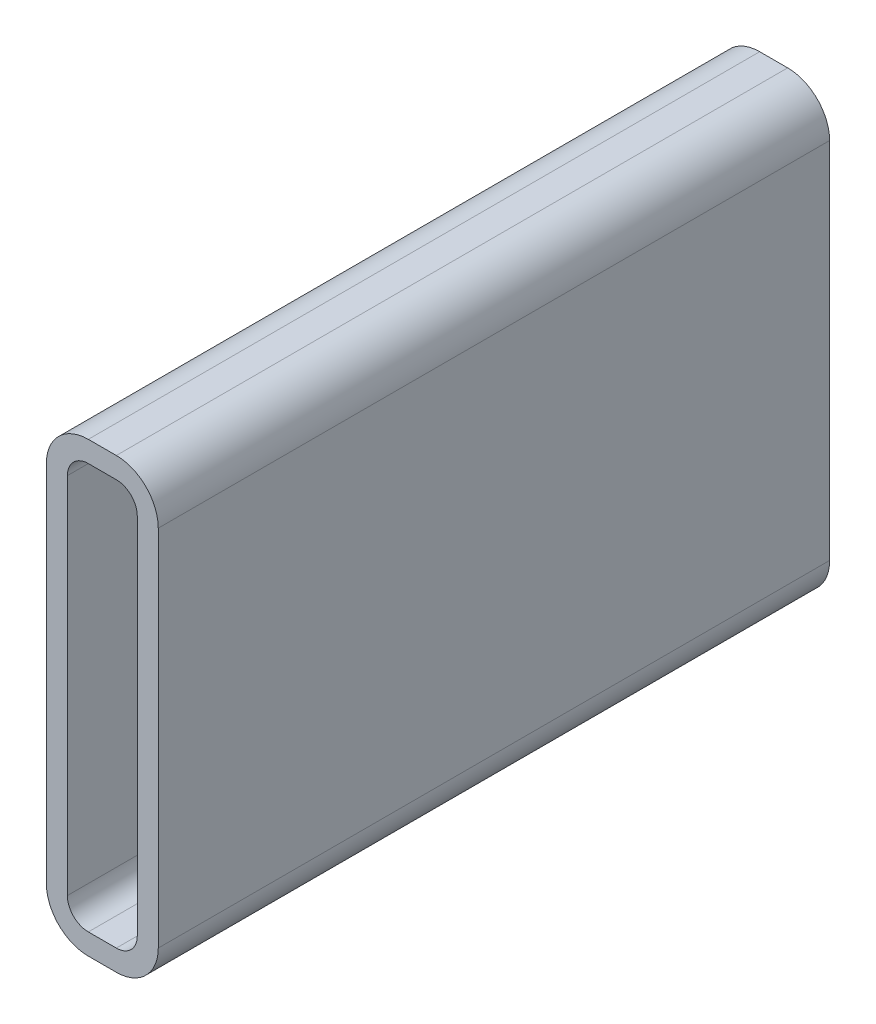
ISO-10303-21;
HEADER;
FILE_DESCRIPTION(('STEP AP214'),'2;1');
FILE_NAME('part.step','',(''),(''),'','','');
FILE_SCHEMA(('AUTOMOTIVE_DESIGN { 1 0 10303 214 1 1 1 1 }'));
ENDSEC;
DATA;
#1=APPLICATION_CONTEXT('core data for automotive mechanical design processes');
#2=APPLICATION_PROTOCOL_DEFINITION('international standard','automotive_design',2000,#1);
#3=PRODUCT_CONTEXT('',#1,'mechanical');
#4=PRODUCT('Part','Part','',(#3));
#5=PRODUCT_RELATED_PRODUCT_CATEGORY('part','',(#4));
#6=PRODUCT_DEFINITION_FORMATION('','',#4);
#7=PRODUCT_DEFINITION_CONTEXT('part definition',#1,'design');
#8=PRODUCT_DEFINITION('design','',#6,#7);
#9=PRODUCT_DEFINITION_SHAPE('','',#8);
#10=(LENGTH_UNIT() NAMED_UNIT(*) SI_UNIT(.MILLI.,.METRE.));
#11=(NAMED_UNIT(*) PLANE_ANGLE_UNIT() SI_UNIT($,.RADIAN.));
#12=(NAMED_UNIT(*) SI_UNIT($,.STERADIAN.) SOLID_ANGLE_UNIT());
#13=UNCERTAINTY_MEASURE_WITH_UNIT(LENGTH_MEASURE(1.E-05),#10,'distance_accuracy_value','');
#14=(GEOMETRIC_REPRESENTATION_CONTEXT(3) GLOBAL_UNCERTAINTY_ASSIGNED_CONTEXT((#13)) GLOBAL_UNIT_ASSIGNED_CONTEXT((#10,
#11,#12)) REPRESENTATION_CONTEXT('',''));
#15=CARTESIAN_POINT('',(0.,0.,0.));
#16=DIRECTION('',(0.,0.,1.));
#17=DIRECTION('',(1.,0.,0.));
#18=AXIS2_PLACEMENT_3D('',#15,#16,#17);
#19=CARTESIAN_POINT('',(19.05,184.15,304.8));
#20=DIRECTION('',(0.,0.,1.));
#21=DIRECTION('',(1.,0.,0.));
#22=AXIS2_PLACEMENT_3D('',#19,#20,#21);
#23=PLANE('',#22);
#24=CARTESIAN_POINT('',(19.05,184.15,304.8));
#25=DIRECTION('',(0.,0.,1.));
#26=DIRECTION('',(1.,0.,0.));
#27=AXIS2_PLACEMENT_3D('',#24,#25,#26);
#28=CIRCLE('',#27,19.05);
#29=CARTESIAN_POINT('',(19.05,203.2,304.8));
#30=VERTEX_POINT('',#29);
#31=CARTESIAN_POINT('',(0.,184.15,304.8));
#32=VERTEX_POINT('',#31);
#33=EDGE_CURVE('E211',#30,#32,#28,.T.);
#34=ORIENTED_EDGE('',*,*,#33,.T.);
#35=DIRECTION('',(0.,-1.,0.));
#36=VECTOR('',#35,1.);
#37=CARTESIAN_POINT('',(0.,19.05,304.8));
#38=LINE('',#37,#36);
#39=CARTESIAN_POINT('',(0.,19.05,304.8));
#40=VERTEX_POINT('',#39);
#41=EDGE_CURVE('E214',#32,#40,#38,.T.);
#42=ORIENTED_EDGE('',*,*,#41,.T.);
#43=CARTESIAN_POINT('',(19.05,19.05,304.8));
#44=DIRECTION('',(0.,0.,1.));
#45=DIRECTION('',(1.,0.,0.));
#46=AXIS2_PLACEMENT_3D('',#43,#44,#45);
#47=CIRCLE('',#46,19.05);
#48=CARTESIAN_POINT('',(19.05,0.,304.8));
#49=VERTEX_POINT('',#48);
#50=EDGE_CURVE('E217',#40,#49,#47,.T.);
#51=ORIENTED_EDGE('',*,*,#50,.T.);
#52=DIRECTION('',(1.,0.,0.));
#53=VECTOR('',#52,1.);
#54=CARTESIAN_POINT('',(31.75,0.,304.8));
#55=LINE('',#54,#53);
#56=CARTESIAN_POINT('',(31.75,0.,304.8));
#57=VERTEX_POINT('',#56);
#58=EDGE_CURVE('E219',#49,#57,#55,.T.);
#59=ORIENTED_EDGE('',*,*,#58,.T.);
#60=CARTESIAN_POINT('',(31.75,19.05,304.8));
#61=DIRECTION('',(0.,0.,1.));
#62=DIRECTION('',(1.,0.,0.));
#63=AXIS2_PLACEMENT_3D('',#60,#61,#62);
#64=CIRCLE('',#63,19.05);
#65=CARTESIAN_POINT('',(50.8,19.05,304.8));
#66=VERTEX_POINT('',#65);
#67=EDGE_CURVE('E221',#57,#66,#64,.T.);
#68=ORIENTED_EDGE('',*,*,#67,.T.);
#69=DIRECTION('',(0.,1.,0.));
#70=VECTOR('',#69,1.);
#71=CARTESIAN_POINT('',(50.8,184.15,304.8));
#72=LINE('',#71,#70);
#73=CARTESIAN_POINT('',(50.8,184.15,304.8));
#74=VERTEX_POINT('',#73);
#75=EDGE_CURVE('E223',#66,#74,#72,.T.);
#76=ORIENTED_EDGE('',*,*,#75,.T.);
#77=CARTESIAN_POINT('',(31.75,184.15,304.8));
#78=DIRECTION('',(0.,0.,1.));
#79=DIRECTION('',(1.,0.,0.));
#80=AXIS2_PLACEMENT_3D('',#77,#78,#79);
#81=CIRCLE('',#80,19.05);
#82=CARTESIAN_POINT('',(31.75,203.2,304.8));
#83=VERTEX_POINT('',#82);
#84=EDGE_CURVE('E225',#74,#83,#81,.T.);
#85=ORIENTED_EDGE('',*,*,#84,.T.);
#86=DIRECTION('',(-1.,0.,0.));
#87=VECTOR('',#86,1.);
#88=CARTESIAN_POINT('',(19.05,203.2,304.8));
#89=LINE('',#88,#87);
#90=EDGE_CURVE('E227',#83,#30,#89,.T.);
#91=ORIENTED_EDGE('',*,*,#90,.T.);
#92=EDGE_LOOP('',(#34,#42,#51,#59,#68,#76,#85,#91));
#93=FACE_BOUND('',#92,.T.);
#94=DIRECTION('',(0.,-1.,0.));
#95=VECTOR('',#94,1.);
#96=CARTESIAN_POINT('',(9.525,19.05,304.8));
#97=LINE('',#96,#95);
#98=CARTESIAN_POINT('',(9.525,184.15,304.8));
#99=VERTEX_POINT('',#98);
#100=CARTESIAN_POINT('',(9.525,19.05,304.8));
#101=VERTEX_POINT('',#100);
#102=EDGE_CURVE('E154',#99,#101,#97,.T.);
#103=ORIENTED_EDGE('',*,*,#102,.F.);
#104=CARTESIAN_POINT('',(19.05,184.15,304.8));
#105=DIRECTION('',(0.,0.,1.));
#106=DIRECTION('',(1.,0.,0.));
#107=AXIS2_PLACEMENT_3D('',#104,#105,#106);
#108=CIRCLE('',#107,9.525);
#109=CARTESIAN_POINT('',(19.05,193.675,304.8));
#110=VERTEX_POINT('',#109);
#111=EDGE_CURVE('E146',#110,#99,#108,.T.);
#112=ORIENTED_EDGE('',*,*,#111,.F.);
#113=DIRECTION('',(-1.,0.,0.));
#114=VECTOR('',#113,1.);
#115=CARTESIAN_POINT('',(19.05,193.675,304.8));
#116=LINE('',#115,#114);
#117=CARTESIAN_POINT('',(31.75,193.675,304.8));
#118=VERTEX_POINT('',#117);
#119=EDGE_CURVE('E179',#118,#110,#116,.T.);
#120=ORIENTED_EDGE('',*,*,#119,.F.);
#121=CARTESIAN_POINT('',(31.75,184.15,304.8));
#122=DIRECTION('',(0.,0.,1.));
#123=DIRECTION('',(1.,0.,0.));
#124=AXIS2_PLACEMENT_3D('',#121,#122,#123);
#125=CIRCLE('',#124,9.525);
#126=CARTESIAN_POINT('',(41.275,184.15,304.8));
#127=VERTEX_POINT('',#126);
#128=EDGE_CURVE('E177',#127,#118,#125,.T.);
#129=ORIENTED_EDGE('',*,*,#128,.F.);
#130=DIRECTION('',(0.,1.,0.));
#131=VECTOR('',#130,1.);
#132=CARTESIAN_POINT('',(41.275,184.15,304.8));
#133=LINE('',#132,#131);
#134=CARTESIAN_POINT('',(41.275,19.05,304.8));
#135=VERTEX_POINT('',#134);
#136=EDGE_CURVE('E175',#135,#127,#133,.T.);
#137=ORIENTED_EDGE('',*,*,#136,.F.);
#138=CARTESIAN_POINT('',(31.75,19.05,304.8));
#139=DIRECTION('',(0.,0.,1.));
#140=DIRECTION('',(1.,0.,0.));
#141=AXIS2_PLACEMENT_3D('',#138,#139,#140);
#142=CIRCLE('',#141,9.525);
#143=CARTESIAN_POINT('',(31.75,9.525,304.8));
#144=VERTEX_POINT('',#143);
#145=EDGE_CURVE('E173',#144,#135,#142,.T.);
#146=ORIENTED_EDGE('',*,*,#145,.F.);
#147=DIRECTION('',(1.,0.,0.));
#148=VECTOR('',#147,1.);
#149=CARTESIAN_POINT('',(31.75,9.525,304.8));
#150=LINE('',#149,#148);
#151=CARTESIAN_POINT('',(19.05,9.525,304.8));
#152=VERTEX_POINT('',#151);
#153=EDGE_CURVE('E169',#152,#144,#150,.T.);
#154=ORIENTED_EDGE('',*,*,#153,.F.);
#155=CARTESIAN_POINT('',(19.05,19.05,304.8));
#156=DIRECTION('',(0.,0.,1.));
#157=DIRECTION('',(1.,0.,0.));
#158=AXIS2_PLACEMENT_3D('',#155,#156,#157);
#159=CIRCLE('',#158,9.525);
#160=EDGE_CURVE('E167',#101,#152,#159,.T.);
#161=ORIENTED_EDGE('',*,*,#160,.F.);
#162=EDGE_LOOP('',(#103,#112,#120,#129,#137,#146,#154,#161));
#163=FACE_BOUND('',#162,.T.);
#164=ADVANCED_FACE('F33',(#93,#163),#23,.T.);
#165=CARTESIAN_POINT('',(19.05,184.15,0.));
#166=DIRECTION('',(0.,0.,1.));
#167=DIRECTION('',(1.,0.,0.));
#168=AXIS2_PLACEMENT_3D('',#165,#166,#167);
#169=PLANE('',#168);
#170=CARTESIAN_POINT('',(19.05,184.15,0.));
#171=DIRECTION('',(0.,0.,1.));
#172=DIRECTION('',(1.,0.,0.));
#173=AXIS2_PLACEMENT_3D('',#170,#171,#172);
#174=CIRCLE('',#173,19.05);
#175=CARTESIAN_POINT('',(19.05,203.2,0.));
#176=VERTEX_POINT('',#175);
#177=CARTESIAN_POINT('',(0.,184.15,0.));
#178=VERTEX_POINT('',#177);
#179=EDGE_CURVE('E162',#176,#178,#174,.T.);
#180=ORIENTED_EDGE('',*,*,#179,.F.);
#181=DIRECTION('',(-1.,0.,0.));
#182=VECTOR('',#181,1.);
#183=CARTESIAN_POINT('',(19.05,203.2,0.));
#184=LINE('',#183,#182);
#185=CARTESIAN_POINT('',(31.75,203.2,0.));
#186=VERTEX_POINT('',#185);
#187=EDGE_CURVE('E215',#186,#176,#184,.T.);
#188=ORIENTED_EDGE('',*,*,#187,.F.);
#189=CARTESIAN_POINT('',(31.75,184.15,0.));
#190=DIRECTION('',(0.,0.,1.));
#191=DIRECTION('',(1.,0.,0.));
#192=AXIS2_PLACEMENT_3D('',#189,#190,#191);
#193=CIRCLE('',#192,19.05);
#194=CARTESIAN_POINT('',(50.8,184.15,0.));
#195=VERTEX_POINT('',#194);
#196=EDGE_CURVE('E242',#195,#186,#193,.T.);
#197=ORIENTED_EDGE('',*,*,#196,.F.);
#198=DIRECTION('',(0.,1.,0.));
#199=VECTOR('',#198,1.);
#200=CARTESIAN_POINT('',(50.8,184.15,0.));
#201=LINE('',#200,#199);
#202=CARTESIAN_POINT('',(50.8,19.05,0.));
#203=VERTEX_POINT('',#202);
#204=EDGE_CURVE('E240',#203,#195,#201,.T.);
#205=ORIENTED_EDGE('',*,*,#204,.F.);
#206=CARTESIAN_POINT('',(31.75,19.05,0.));
#207=DIRECTION('',(0.,0.,1.));
#208=DIRECTION('',(1.,0.,0.));
#209=AXIS2_PLACEMENT_3D('',#206,#207,#208);
#210=CIRCLE('',#209,19.05);
#211=CARTESIAN_POINT('',(31.75,0.,0.));
#212=VERTEX_POINT('',#211);
#213=EDGE_CURVE('E238',#212,#203,#210,.T.);
#214=ORIENTED_EDGE('',*,*,#213,.F.);
#215=DIRECTION('',(1.,0.,0.));
#216=VECTOR('',#215,1.);
#217=CARTESIAN_POINT('',(31.75,0.,0.));
#218=LINE('',#217,#216);
#219=CARTESIAN_POINT('',(19.05,0.,0.));
#220=VERTEX_POINT('',#219);
#221=EDGE_CURVE('E236',#220,#212,#218,.T.);
#222=ORIENTED_EDGE('',*,*,#221,.F.);
#223=CARTESIAN_POINT('',(19.05,19.05,0.));
#224=DIRECTION('',(0.,0.,1.));
#225=DIRECTION('',(1.,0.,0.));
#226=AXIS2_PLACEMENT_3D('',#223,#224,#225);
#227=CIRCLE('',#226,19.05);
#228=CARTESIAN_POINT('',(0.,19.05,0.));
#229=VERTEX_POINT('',#228);
#230=EDGE_CURVE('E234',#229,#220,#227,.T.);
#231=ORIENTED_EDGE('',*,*,#230,.F.);
#232=DIRECTION('',(0.,-1.,0.));
#233=VECTOR('',#232,1.);
#234=CARTESIAN_POINT('',(0.,19.05,0.));
#235=LINE('',#234,#233);
#236=EDGE_CURVE('E232',#178,#229,#235,.T.);
#237=ORIENTED_EDGE('',*,*,#236,.F.);
#238=EDGE_LOOP('',(#180,#188,#197,#205,#214,#222,#231,#237));
#239=FACE_BOUND('',#238,.T.);
#240=CARTESIAN_POINT('',(19.05,184.15,0.));
#241=DIRECTION('',(0.,0.,1.));
#242=DIRECTION('',(1.,0.,0.));
#243=AXIS2_PLACEMENT_3D('',#240,#241,#242);
#244=CIRCLE('',#243,9.525);
#245=CARTESIAN_POINT('',(19.05,193.675,0.));
#246=VERTEX_POINT('',#245);
#247=CARTESIAN_POINT('',(9.525,184.15,0.));
#248=VERTEX_POINT('',#247);
#249=EDGE_CURVE('E56',#246,#248,#244,.T.);
#250=ORIENTED_EDGE('',*,*,#249,.T.);
#251=DIRECTION('',(0.,-1.,0.));
#252=VECTOR('',#251,1.);
#253=CARTESIAN_POINT('',(9.525,19.05,0.));
#254=LINE('',#253,#252);
#255=CARTESIAN_POINT('',(9.525,19.05,0.));
#256=VERTEX_POINT('',#255);
#257=EDGE_CURVE('E161',#248,#256,#254,.T.);
#258=ORIENTED_EDGE('',*,*,#257,.T.);
#259=CARTESIAN_POINT('',(19.05,19.05,0.));
#260=DIRECTION('',(0.,0.,1.));
#261=DIRECTION('',(1.,0.,0.));
#262=AXIS2_PLACEMENT_3D('',#259,#260,#261);
#263=CIRCLE('',#262,9.525);
#264=CARTESIAN_POINT('',(19.05,9.525,0.));
#265=VERTEX_POINT('',#264);
#266=EDGE_CURVE('E183',#256,#265,#263,.T.);
#267=ORIENTED_EDGE('',*,*,#266,.T.);
#268=DIRECTION('',(1.,0.,0.));
#269=VECTOR('',#268,1.);
#270=CARTESIAN_POINT('',(31.75,9.525,0.));
#271=LINE('',#270,#269);
#272=CARTESIAN_POINT('',(31.75,9.525,0.));
#273=VERTEX_POINT('',#272);
#274=EDGE_CURVE('E186',#265,#273,#271,.T.);
#275=ORIENTED_EDGE('',*,*,#274,.T.);
#276=CARTESIAN_POINT('',(31.75,19.05,0.));
#277=DIRECTION('',(0.,0.,1.));
#278=DIRECTION('',(1.,0.,0.));
#279=AXIS2_PLACEMENT_3D('',#276,#277,#278);
#280=CIRCLE('',#279,9.525);
#281=CARTESIAN_POINT('',(41.275,19.05,0.));
#282=VERTEX_POINT('',#281);
#283=EDGE_CURVE('E189',#273,#282,#280,.T.);
#284=ORIENTED_EDGE('',*,*,#283,.T.);
#285=DIRECTION('',(0.,1.,0.));
#286=VECTOR('',#285,1.);
#287=CARTESIAN_POINT('',(41.275,184.15,0.));
#288=LINE('',#287,#286);
#289=CARTESIAN_POINT('',(41.275,184.15,0.));
#290=VERTEX_POINT('',#289);
#291=EDGE_CURVE('E192',#282,#290,#288,.T.);
#292=ORIENTED_EDGE('',*,*,#291,.T.);
#293=CARTESIAN_POINT('',(31.75,184.15,0.));
#294=DIRECTION('',(0.,0.,1.));
#295=DIRECTION('',(1.,0.,0.));
#296=AXIS2_PLACEMENT_3D('',#293,#294,#295);
#297=CIRCLE('',#296,9.525);
#298=CARTESIAN_POINT('',(31.75,193.675,0.));
#299=VERTEX_POINT('',#298);
#300=EDGE_CURVE('E195',#290,#299,#297,.T.);
#301=ORIENTED_EDGE('',*,*,#300,.T.);
#302=DIRECTION('',(-1.,0.,0.));
#303=VECTOR('',#302,1.);
#304=CARTESIAN_POINT('',(19.05,193.675,0.));
#305=LINE('',#304,#303);
#306=EDGE_CURVE('E155',#299,#246,#305,.T.);
#307=ORIENTED_EDGE('',*,*,#306,.T.);
#308=EDGE_LOOP('',(#250,#258,#267,#275,#284,#292,#301,#307));
#309=FACE_BOUND('',#308,.T.);
#310=ADVANCED_FACE('F272',(#239,#309),#169,.F.);
#311=CARTESIAN_POINT('',(19.05,184.15,304.8));
#312=DIRECTION('',(0.,0.,-1.));
#313=DIRECTION('',(-1.,0.,0.));
#314=AXIS2_PLACEMENT_3D('',#311,#312,#313);
#315=CYLINDRICAL_SURFACE('',#314,19.05);
#316=ORIENTED_EDGE('',*,*,#179,.T.);
#317=DIRECTION('',(0.,0.,-1.));
#318=VECTOR('',#317,1.);
#319=CARTESIAN_POINT('',(0.,184.15,304.8));
#320=LINE('',#319,#318);
#321=EDGE_CURVE('E11',#32,#178,#320,.T.);
#322=ORIENTED_EDGE('',*,*,#321,.F.);
#323=ORIENTED_EDGE('',*,*,#33,.F.);
#324=DIRECTION('',(0.,0.,-1.));
#325=VECTOR('',#324,1.);
#326=CARTESIAN_POINT('',(19.05,203.2,304.8));
#327=LINE('',#326,#325);
#328=EDGE_CURVE('E229',#30,#176,#327,.T.);
#329=ORIENTED_EDGE('',*,*,#328,.T.);
#330=EDGE_LOOP('',(#316,#322,#323,#329));
#331=FACE_BOUND('',#330,.T.);
#332=ADVANCED_FACE('F35',(#331),#315,.T.);
#333=CARTESIAN_POINT('',(0.,19.05,304.8));
#334=DIRECTION('',(1.,0.,0.));
#335=DIRECTION('',(0.,0.,-1.));
#336=AXIS2_PLACEMENT_3D('',#333,#334,#335);
#337=PLANE('',#336);
#338=ORIENTED_EDGE('',*,*,#236,.T.);
#339=DIRECTION('',(0.,0.,-1.));
#340=VECTOR('',#339,1.);
#341=CARTESIAN_POINT('',(0.,19.05,304.8));
#342=LINE('',#341,#340);
#343=EDGE_CURVE('E41',#40,#229,#342,.T.);
#344=ORIENTED_EDGE('',*,*,#343,.F.);
#345=ORIENTED_EDGE('',*,*,#41,.F.);
#346=ORIENTED_EDGE('',*,*,#321,.T.);
#347=EDGE_LOOP('',(#338,#344,#345,#346));
#348=FACE_BOUND('',#347,.T.);
#349=ADVANCED_FACE('F289',(#348),#337,.F.);
#350=CARTESIAN_POINT('',(19.05,19.05,304.8));
#351=DIRECTION('',(0.,0.,-1.));
#352=DIRECTION('',(-1.,0.,0.));
#353=AXIS2_PLACEMENT_3D('',#350,#351,#352);
#354=CYLINDRICAL_SURFACE('',#353,19.05);
#355=ORIENTED_EDGE('',*,*,#230,.T.);
#356=DIRECTION('',(0.,0.,-1.));
#357=VECTOR('',#356,1.);
#358=CARTESIAN_POINT('',(19.05,0.,304.8));
#359=LINE('',#358,#357);
#360=EDGE_CURVE('E259',#49,#220,#359,.T.);
#361=ORIENTED_EDGE('',*,*,#360,.F.);
#362=ORIENTED_EDGE('',*,*,#50,.F.);
#363=ORIENTED_EDGE('',*,*,#343,.T.);
#364=EDGE_LOOP('',(#355,#361,#362,#363));
#365=FACE_BOUND('',#364,.T.);
#366=ADVANCED_FACE('F266',(#365),#354,.T.);
#367=CARTESIAN_POINT('',(31.75,0.,304.8));
#368=DIRECTION('',(0.,1.,0.));
#369=DIRECTION('',(0.,0.,1.));
#370=AXIS2_PLACEMENT_3D('',#367,#368,#369);
#371=PLANE('',#370);
#372=ORIENTED_EDGE('',*,*,#221,.T.);
#373=DIRECTION('',(0.,0.,-1.));
#374=VECTOR('',#373,1.);
#375=CARTESIAN_POINT('',(31.75,0.,304.8));
#376=LINE('',#375,#374);
#377=EDGE_CURVE('E256',#57,#212,#376,.T.);
#378=ORIENTED_EDGE('',*,*,#377,.F.);
#379=ORIENTED_EDGE('',*,*,#58,.F.);
#380=ORIENTED_EDGE('',*,*,#360,.T.);
#381=EDGE_LOOP('',(#372,#378,#379,#380));
#382=FACE_BOUND('',#381,.T.);
#383=ADVANCED_FACE('F278',(#382),#371,.F.);
#384=CARTESIAN_POINT('',(31.75,19.05,304.8));
#385=DIRECTION('',(0.,0.,-1.));
#386=DIRECTION('',(-1.,0.,0.));
#387=AXIS2_PLACEMENT_3D('',#384,#385,#386);
#388=CYLINDRICAL_SURFACE('',#387,19.05);
#389=ORIENTED_EDGE('',*,*,#213,.T.);
#390=DIRECTION('',(0.,0.,-1.));
#391=VECTOR('',#390,1.);
#392=CARTESIAN_POINT('',(50.8,19.05,304.8));
#393=LINE('',#392,#391);
#394=EDGE_CURVE('E253',#66,#203,#393,.T.);
#395=ORIENTED_EDGE('',*,*,#394,.F.);
#396=ORIENTED_EDGE('',*,*,#67,.F.);
#397=ORIENTED_EDGE('',*,*,#377,.T.);
#398=EDGE_LOOP('',(#389,#395,#396,#397));
#399=FACE_BOUND('',#398,.T.);
#400=ADVANCED_FACE('F282',(#399),#388,.T.);
#401=CARTESIAN_POINT('',(50.8,184.15,304.8));
#402=DIRECTION('',(-1.,0.,0.));
#403=DIRECTION('',(0.,0.,1.));
#404=AXIS2_PLACEMENT_3D('',#401,#402,#403);
#405=PLANE('',#404);
#406=ORIENTED_EDGE('',*,*,#204,.T.);
#407=DIRECTION('',(0.,0.,-1.));
#408=VECTOR('',#407,1.);
#409=CARTESIAN_POINT('',(50.8,184.15,304.8));
#410=LINE('',#409,#408);
#411=EDGE_CURVE('E250',#74,#195,#410,.T.);
#412=ORIENTED_EDGE('',*,*,#411,.F.);
#413=ORIENTED_EDGE('',*,*,#75,.F.);
#414=ORIENTED_EDGE('',*,*,#394,.T.);
#415=EDGE_LOOP('',(#406,#412,#413,#414));
#416=FACE_BOUND('',#415,.T.);
#417=ADVANCED_FACE('F302',(#416),#405,.F.);
#418=CARTESIAN_POINT('',(31.75,184.15,304.8));
#419=DIRECTION('',(0.,0.,-1.));
#420=DIRECTION('',(-1.,0.,0.));
#421=AXIS2_PLACEMENT_3D('',#418,#419,#420);
#422=CYLINDRICAL_SURFACE('',#421,19.05);
#423=ORIENTED_EDGE('',*,*,#196,.T.);
#424=DIRECTION('',(0.,0.,-1.));
#425=VECTOR('',#424,1.);
#426=CARTESIAN_POINT('',(31.75,203.2,304.8));
#427=LINE('',#426,#425);
#428=EDGE_CURVE('E247',#83,#186,#427,.T.);
#429=ORIENTED_EDGE('',*,*,#428,.F.);
#430=ORIENTED_EDGE('',*,*,#84,.F.);
#431=ORIENTED_EDGE('',*,*,#411,.T.);
#432=EDGE_LOOP('',(#423,#429,#430,#431));
#433=FACE_BOUND('',#432,.T.);
#434=ADVANCED_FACE('F300',(#433),#422,.T.);
#435=CARTESIAN_POINT('',(19.05,203.2,304.8));
#436=DIRECTION('',(0.,-1.,0.));
#437=DIRECTION('',(0.,0.,-1.));
#438=AXIS2_PLACEMENT_3D('',#435,#436,#437);
#439=PLANE('',#438);
#440=ORIENTED_EDGE('',*,*,#187,.T.);
#441=ORIENTED_EDGE('',*,*,#328,.F.);
#442=ORIENTED_EDGE('',*,*,#90,.F.);
#443=ORIENTED_EDGE('',*,*,#428,.T.);
#444=EDGE_LOOP('',(#440,#441,#442,#443));
#445=FACE_BOUND('',#444,.T.);
#446=ADVANCED_FACE('F295',(#445),#439,.F.);
#447=CARTESIAN_POINT('',(19.05,184.15,304.8));
#448=DIRECTION('',(0.,0.,-1.));
#449=DIRECTION('',(-1.,0.,0.));
#450=AXIS2_PLACEMENT_3D('',#447,#448,#449);
#451=CYLINDRICAL_SURFACE('',#450,9.525);
#452=ORIENTED_EDGE('',*,*,#249,.F.);
#453=DIRECTION('',(0.,0.,-1.));
#454=VECTOR('',#453,1.);
#455=CARTESIAN_POINT('',(19.05,193.675,304.8));
#456=LINE('',#455,#454);
#457=EDGE_CURVE('E150',#110,#246,#456,.T.);
#458=ORIENTED_EDGE('',*,*,#457,.F.);
#459=ORIENTED_EDGE('',*,*,#111,.T.);
#460=DIRECTION('',(0.,0.,-1.));
#461=VECTOR('',#460,1.);
#462=CARTESIAN_POINT('',(9.525,184.15,304.8));
#463=LINE('',#462,#461);
#464=EDGE_CURVE('E149',#99,#248,#463,.T.);
#465=ORIENTED_EDGE('',*,*,#464,.T.);
#466=EDGE_LOOP('',(#452,#458,#459,#465));
#467=FACE_BOUND('',#466,.T.);
#468=ADVANCED_FACE('F148',(#467),#451,.F.);
#469=CARTESIAN_POINT('',(9.525,19.05,304.8));
#470=DIRECTION('',(1.,0.,0.));
#471=DIRECTION('',(0.,0.,-1.));
#472=AXIS2_PLACEMENT_3D('',#469,#470,#471);
#473=PLANE('',#472);
#474=ORIENTED_EDGE('',*,*,#257,.F.);
#475=ORIENTED_EDGE('',*,*,#464,.F.);
#476=ORIENTED_EDGE('',*,*,#102,.T.);
#477=DIRECTION('',(0.,0.,-1.));
#478=VECTOR('',#477,1.);
#479=CARTESIAN_POINT('',(9.525,19.05,304.8));
#480=LINE('',#479,#478);
#481=EDGE_CURVE('E163',#101,#256,#480,.T.);
#482=ORIENTED_EDGE('',*,*,#481,.T.);
#483=EDGE_LOOP('',(#474,#475,#476,#482));
#484=FACE_BOUND('',#483,.T.);
#485=ADVANCED_FACE('F158',(#484),#473,.T.);
#486=CARTESIAN_POINT('',(19.05,19.05,304.8));
#487=DIRECTION('',(0.,0.,-1.));
#488=DIRECTION('',(-1.,0.,0.));
#489=AXIS2_PLACEMENT_3D('',#486,#487,#488);
#490=CYLINDRICAL_SURFACE('',#489,9.525);
#491=ORIENTED_EDGE('',*,*,#266,.F.);
#492=ORIENTED_EDGE('',*,*,#481,.F.);
#493=ORIENTED_EDGE('',*,*,#160,.T.);
#494=DIRECTION('',(0.,0.,-1.));
#495=VECTOR('',#494,1.);
#496=CARTESIAN_POINT('',(19.05,9.525,304.8));
#497=LINE('',#496,#495);
#498=EDGE_CURVE('E208',#152,#265,#497,.T.);
#499=ORIENTED_EDGE('',*,*,#498,.T.);
#500=EDGE_LOOP('',(#491,#492,#493,#499));
#501=FACE_BOUND('',#500,.T.);
#502=ADVANCED_FACE('F327',(#501),#490,.F.);
#503=CARTESIAN_POINT('',(31.75,9.525,304.8));
#504=DIRECTION('',(0.,1.,0.));
#505=DIRECTION('',(0.,0.,1.));
#506=AXIS2_PLACEMENT_3D('',#503,#504,#505);
#507=PLANE('',#506);
#508=ORIENTED_EDGE('',*,*,#274,.F.);
#509=ORIENTED_EDGE('',*,*,#498,.F.);
#510=ORIENTED_EDGE('',*,*,#153,.T.);
#511=DIRECTION('',(0.,0.,-1.));
#512=VECTOR('',#511,1.);
#513=CARTESIAN_POINT('',(31.75,9.525,304.8));
#514=LINE('',#513,#512);
#515=EDGE_CURVE('E206',#144,#273,#514,.T.);
#516=ORIENTED_EDGE('',*,*,#515,.T.);
#517=EDGE_LOOP('',(#508,#509,#510,#516));
#518=FACE_BOUND('',#517,.T.);
#519=ADVANCED_FACE('F331',(#518),#507,.T.);
#520=CARTESIAN_POINT('',(31.75,19.05,304.8));
#521=DIRECTION('',(0.,0.,-1.));
#522=DIRECTION('',(-1.,0.,0.));
#523=AXIS2_PLACEMENT_3D('',#520,#521,#522);
#524=CYLINDRICAL_SURFACE('',#523,9.525);
#525=ORIENTED_EDGE('',*,*,#283,.F.);
#526=ORIENTED_EDGE('',*,*,#515,.F.);
#527=ORIENTED_EDGE('',*,*,#145,.T.);
#528=DIRECTION('',(0.,0.,-1.));
#529=VECTOR('',#528,1.);
#530=CARTESIAN_POINT('',(41.275,19.05,304.8));
#531=LINE('',#530,#529);
#532=EDGE_CURVE('E204',#135,#282,#531,.T.);
#533=ORIENTED_EDGE('',*,*,#532,.T.);
#534=EDGE_LOOP('',(#525,#526,#527,#533));
#535=FACE_BOUND('',#534,.T.);
#536=ADVANCED_FACE('F337',(#535),#524,.F.);
#537=CARTESIAN_POINT('',(41.275,184.15,304.8));
#538=DIRECTION('',(-1.,0.,0.));
#539=DIRECTION('',(0.,0.,1.));
#540=AXIS2_PLACEMENT_3D('',#537,#538,#539);
#541=PLANE('',#540);
#542=ORIENTED_EDGE('',*,*,#291,.F.);
#543=ORIENTED_EDGE('',*,*,#532,.F.);
#544=ORIENTED_EDGE('',*,*,#136,.T.);
#545=DIRECTION('',(0.,0.,-1.));
#546=VECTOR('',#545,1.);
#547=CARTESIAN_POINT('',(41.275,184.15,304.8));
#548=LINE('',#547,#546);
#549=EDGE_CURVE('E202',#127,#290,#548,.T.);
#550=ORIENTED_EDGE('',*,*,#549,.T.);
#551=EDGE_LOOP('',(#542,#543,#544,#550));
#552=FACE_BOUND('',#551,.T.);
#553=ADVANCED_FACE('F341',(#552),#541,.T.);
#554=CARTESIAN_POINT('',(31.75,184.15,304.8));
#555=DIRECTION('',(0.,0.,-1.));
#556=DIRECTION('',(-1.,0.,0.));
#557=AXIS2_PLACEMENT_3D('',#554,#555,#556);
#558=CYLINDRICAL_SURFACE('',#557,9.525);
#559=ORIENTED_EDGE('',*,*,#300,.F.);
#560=ORIENTED_EDGE('',*,*,#549,.F.);
#561=ORIENTED_EDGE('',*,*,#128,.T.);
#562=DIRECTION('',(0.,0.,-1.));
#563=VECTOR('',#562,1.);
#564=CARTESIAN_POINT('',(31.75,193.675,304.8));
#565=LINE('',#564,#563);
#566=EDGE_CURVE('E48',#118,#299,#565,.T.);
#567=ORIENTED_EDGE('',*,*,#566,.T.);
#568=EDGE_LOOP('',(#559,#560,#561,#567));
#569=FACE_BOUND('',#568,.T.);
#570=ADVANCED_FACE('F345',(#569),#558,.F.);
#571=CARTESIAN_POINT('',(19.05,193.675,304.8));
#572=DIRECTION('',(0.,-1.,0.));
#573=DIRECTION('',(0.,0.,-1.));
#574=AXIS2_PLACEMENT_3D('',#571,#572,#573);
#575=PLANE('',#574);
#576=ORIENTED_EDGE('',*,*,#306,.F.);
#577=ORIENTED_EDGE('',*,*,#566,.F.);
#578=ORIENTED_EDGE('',*,*,#119,.T.);
#579=ORIENTED_EDGE('',*,*,#457,.T.);
#580=EDGE_LOOP('',(#576,#577,#578,#579));
#581=FACE_BOUND('',#580,.T.);
#582=ADVANCED_FACE('F349',(#581),#575,.T.);
#583=CLOSED_SHELL('',(#164,#310,#332,#349,#366,#383,#400,#417,#434,#446,#468,#485,#502,#519,
#536,#553,#570,#582));
#584=MANIFOLD_SOLID_BREP('B2',#583);
#585=ADVANCED_BREP_SHAPE_REPRESENTATION('',(#18,#584),#14);
#586=SHAPE_DEFINITION_REPRESENTATION(#9,#585);
ENDSEC;
END-ISO-10303-21;
